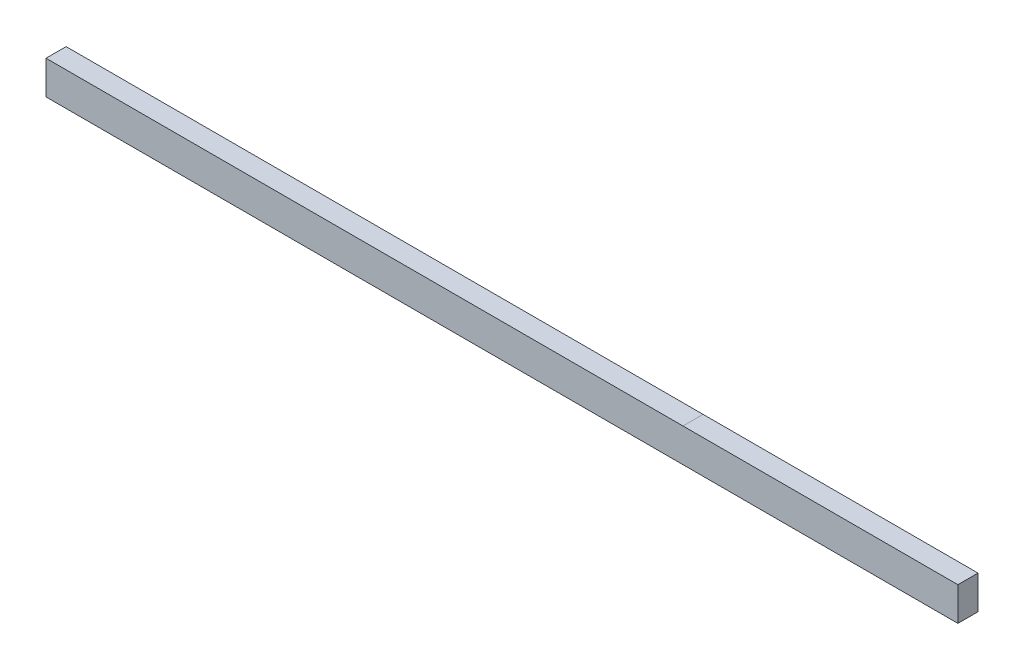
ISO-10303-21;
HEADER;
FILE_DESCRIPTION(('STEP AP214'),'2;1');
FILE_NAME('part.step','',(''),(''),'','','');
FILE_SCHEMA(('AUTOMOTIVE_DESIGN { 1 0 10303 214 1 1 1 1 }'));
ENDSEC;
DATA;
#1=APPLICATION_CONTEXT('core data for automotive mechanical design processes');
#2=APPLICATION_PROTOCOL_DEFINITION('international standard','automotive_design',2000,#1);
#3=PRODUCT_CONTEXT('',#1,'mechanical');
#4=PRODUCT('Part','Part','',(#3));
#5=PRODUCT_RELATED_PRODUCT_CATEGORY('part','',(#4));
#6=PRODUCT_DEFINITION_FORMATION('','',#4);
#7=PRODUCT_DEFINITION_CONTEXT('part definition',#1,'design');
#8=PRODUCT_DEFINITION('design','',#6,#7);
#9=PRODUCT_DEFINITION_SHAPE('','',#8);
#10=(LENGTH_UNIT() NAMED_UNIT(*) SI_UNIT(.MILLI.,.METRE.));
#11=(NAMED_UNIT(*) PLANE_ANGLE_UNIT() SI_UNIT($,.RADIAN.));
#12=(NAMED_UNIT(*) SI_UNIT($,.STERADIAN.) SOLID_ANGLE_UNIT());
#13=UNCERTAINTY_MEASURE_WITH_UNIT(LENGTH_MEASURE(1.E-05),#10,'distance_accuracy_value','');
#14=(GEOMETRIC_REPRESENTATION_CONTEXT(3) GLOBAL_UNCERTAINTY_ASSIGNED_CONTEXT((#13)) GLOBAL_UNIT_ASSIGNED_CONTEXT((#10,
#11,#12)) REPRESENTATION_CONTEXT('',''));
#15=CARTESIAN_POINT('',(0.,0.,0.));
#16=DIRECTION('',(0.,0.,1.));
#17=DIRECTION('',(1.,0.,0.));
#18=AXIS2_PLACEMENT_3D('',#15,#16,#17);
#19=CARTESIAN_POINT('',(680.,-12.5,7.5));
#20=DIRECTION('',(0.,1.,0.));
#21=DIRECTION('',(0.,0.,1.));
#22=AXIS2_PLACEMENT_3D('',#19,#20,#21);
#23=PLANE('',#22);
#24=DIRECTION('',(0.,0.,-1.));
#25=VECTOR('',#24,1.);
#26=CARTESIAN_POINT('',(600.,-12.5,7.5));
#27=LINE('',#26,#25);
#28=CARTESIAN_POINT('',(600.,-12.5,7.5));
#29=VERTEX_POINT('',#28);
#30=CARTESIAN_POINT('',(600.,-12.5,-7.5));
#31=VERTEX_POINT('',#30);
#32=EDGE_CURVE('E11',#29,#31,#27,.T.);
#33=ORIENTED_EDGE('',*,*,#32,.F.);
#34=DIRECTION('',(-1.,0.,0.));
#35=VECTOR('',#34,1.);
#36=CARTESIAN_POINT('',(680.,-12.5,7.5));
#37=LINE('',#36,#35);
#38=CARTESIAN_POINT('',(0.,-12.5,7.5));
#39=VERTEX_POINT('',#38);
#40=EDGE_CURVE('E82',#29,#39,#37,.T.);
#41=ORIENTED_EDGE('',*,*,#40,.T.);
#42=DIRECTION('',(0.,0.,-1.));
#43=VECTOR('',#42,1.);
#44=CARTESIAN_POINT('',(0.,-12.5,7.5));
#45=LINE('',#44,#43);
#46=CARTESIAN_POINT('',(0.,-12.5,-7.5));
#47=VERTEX_POINT('',#46);
#48=EDGE_CURVE('E84',#39,#47,#45,.T.);
#49=ORIENTED_EDGE('',*,*,#48,.T.);
#50=DIRECTION('',(-1.,0.,0.));
#51=VECTOR('',#50,1.);
#52=CARTESIAN_POINT('',(680.,-12.5,-7.5));
#53=LINE('',#52,#51);
#54=EDGE_CURVE('E124',#31,#47,#53,.T.);
#55=ORIENTED_EDGE('',*,*,#54,.F.);
#56=EDGE_LOOP('',(#33,#41,#49,#55));
#57=FACE_BOUND('',#56,.T.);
#58=ADVANCED_FACE('F33',(#57),#23,.F.);
#59=CARTESIAN_POINT('',(680.,12.5,7.5));
#60=DIRECTION('',(0.,-1.,0.));
#61=DIRECTION('',(0.,0.,-1.));
#62=AXIS2_PLACEMENT_3D('',#59,#60,#61);
#63=PLANE('',#62);
#64=DIRECTION('',(0.,0.,1.));
#65=VECTOR('',#64,1.);
#66=CARTESIAN_POINT('',(475.,12.5,7.5));
#67=LINE('',#66,#65);
#68=CARTESIAN_POINT('',(475.,12.5,-7.5));
#69=VERTEX_POINT('',#68);
#70=CARTESIAN_POINT('',(475.,12.5,7.5));
#71=VERTEX_POINT('',#70);
#72=EDGE_CURVE('E42',#69,#71,#67,.T.);
#73=ORIENTED_EDGE('',*,*,#72,.F.);
#74=DIRECTION('',(-1.,0.,0.));
#75=VECTOR('',#74,1.);
#76=CARTESIAN_POINT('',(680.,12.5,-7.5));
#77=LINE('',#76,#75);
#78=CARTESIAN_POINT('',(0.,12.5,-7.5));
#79=VERTEX_POINT('',#78);
#80=EDGE_CURVE('E120',#69,#79,#77,.T.);
#81=ORIENTED_EDGE('',*,*,#80,.T.);
#82=DIRECTION('',(0.,0.,1.));
#83=VECTOR('',#82,1.);
#84=CARTESIAN_POINT('',(0.,12.5,7.5));
#85=LINE('',#84,#83);
#86=CARTESIAN_POINT('',(0.,12.5,7.5));
#87=VERTEX_POINT('',#86);
#88=EDGE_CURVE('E107',#79,#87,#85,.T.);
#89=ORIENTED_EDGE('',*,*,#88,.T.);
#90=DIRECTION('',(-1.,0.,0.));
#91=VECTOR('',#90,1.);
#92=CARTESIAN_POINT('',(680.,12.5,7.5));
#93=LINE('',#92,#91);
#94=EDGE_CURVE('E102',#71,#87,#93,.T.);
#95=ORIENTED_EDGE('',*,*,#94,.F.);
#96=EDGE_LOOP('',(#73,#81,#89,#95));
#97=FACE_BOUND('',#96,.T.);
#98=ADVANCED_FACE('F137',(#97),#63,.F.);
#99=CARTESIAN_POINT('',(680.,12.5,7.5));
#100=DIRECTION('',(0.,0.,-1.));
#101=DIRECTION('',(0.,1.,0.));
#102=AXIS2_PLACEMENT_3D('',#99,#100,#101);
#103=PLANE('',#102);
#104=DIRECTION('',(0.,-1.,0.));
#105=VECTOR('',#104,1.);
#106=CARTESIAN_POINT('',(0.,12.5,7.5));
#107=LINE('',#106,#105);
#108=EDGE_CURVE('E96',#87,#39,#107,.T.);
#109=ORIENTED_EDGE('',*,*,#108,.T.);
#110=ORIENTED_EDGE('',*,*,#40,.F.);
#111=CARTESIAN_POINT('',(680.,-12.5,7.5));
#112=VERTEX_POINT('',#111);
#113=EDGE_CURVE('E89',#112,#29,#37,.T.);
#114=ORIENTED_EDGE('',*,*,#113,.F.);
#115=DIRECTION('',(0.,-1.,0.));
#116=VECTOR('',#115,1.);
#117=CARTESIAN_POINT('',(680.,12.5,7.5));
#118=LINE('',#117,#116);
#119=CARTESIAN_POINT('',(680.,12.5,7.5));
#120=VERTEX_POINT('',#119);
#121=EDGE_CURVE('E109',#120,#112,#118,.T.);
#122=ORIENTED_EDGE('',*,*,#121,.F.);
#123=EDGE_CURVE('E118',#120,#71,#93,.T.);
#124=ORIENTED_EDGE('',*,*,#123,.T.);
#125=ORIENTED_EDGE('',*,*,#94,.T.);
#126=EDGE_LOOP('',(#109,#110,#114,#122,#124,#125));
#127=FACE_BOUND('',#126,.T.);
#128=ADVANCED_FACE('F35',(#127),#103,.F.);
#129=ORIENTED_EDGE('',*,*,#113,.T.);
#130=ORIENTED_EDGE('',*,*,#32,.T.);
#131=CARTESIAN_POINT('',(680.,-12.5,-7.5));
#132=VERTEX_POINT('',#131);
#133=EDGE_CURVE('E90',#132,#31,#53,.T.);
#134=ORIENTED_EDGE('',*,*,#133,.F.);
#135=DIRECTION('',(0.,0.,-1.));
#136=VECTOR('',#135,1.);
#137=CARTESIAN_POINT('',(680.,-12.5,7.5));
#138=LINE('',#137,#136);
#139=EDGE_CURVE('E112',#112,#132,#138,.T.);
#140=ORIENTED_EDGE('',*,*,#139,.F.);
#141=EDGE_LOOP('',(#129,#130,#134,#140));
#142=FACE_BOUND('',#141,.T.);
#143=ADVANCED_FACE('F143',(#142),#23,.F.);
#144=CARTESIAN_POINT('',(680.,12.5,-7.5));
#145=DIRECTION('',(0.,0.,1.));
#146=DIRECTION('',(0.,-1.,0.));
#147=AXIS2_PLACEMENT_3D('',#144,#145,#146);
#148=PLANE('',#147);
#149=DIRECTION('',(0.,1.,0.));
#150=VECTOR('',#149,1.);
#151=CARTESIAN_POINT('',(0.,12.5,-7.5));
#152=LINE('',#151,#150);
#153=EDGE_CURVE('E98',#47,#79,#152,.T.);
#154=ORIENTED_EDGE('',*,*,#153,.T.);
#155=ORIENTED_EDGE('',*,*,#80,.F.);
#156=CARTESIAN_POINT('',(680.,12.5,-7.5));
#157=VERTEX_POINT('',#156);
#158=EDGE_CURVE('E121',#157,#69,#77,.T.);
#159=ORIENTED_EDGE('',*,*,#158,.F.);
#160=DIRECTION('',(0.,1.,0.));
#161=VECTOR('',#160,1.);
#162=CARTESIAN_POINT('',(680.,12.5,-7.5));
#163=LINE('',#162,#161);
#164=EDGE_CURVE('E114',#132,#157,#163,.T.);
#165=ORIENTED_EDGE('',*,*,#164,.F.);
#166=ORIENTED_EDGE('',*,*,#133,.T.);
#167=ORIENTED_EDGE('',*,*,#54,.T.);
#168=EDGE_LOOP('',(#154,#155,#159,#165,#166,#167));
#169=FACE_BOUND('',#168,.T.);
#170=ADVANCED_FACE('F142',(#169),#148,.F.);
#171=ORIENTED_EDGE('',*,*,#158,.T.);
#172=ORIENTED_EDGE('',*,*,#72,.T.);
#173=ORIENTED_EDGE('',*,*,#123,.F.);
#174=DIRECTION('',(0.,0.,1.));
#175=VECTOR('',#174,1.);
#176=CARTESIAN_POINT('',(680.,12.5,7.5));
#177=LINE('',#176,#175);
#178=EDGE_CURVE('E116',#157,#120,#177,.T.);
#179=ORIENTED_EDGE('',*,*,#178,.F.);
#180=EDGE_LOOP('',(#171,#172,#173,#179));
#181=FACE_BOUND('',#180,.T.);
#182=ADVANCED_FACE('F131',(#181),#63,.F.);
#183=CARTESIAN_POINT('',(680.,-12.5,7.5));
#184=DIRECTION('',(1.,0.,0.));
#185=DIRECTION('',(0.,0.,-1.));
#186=AXIS2_PLACEMENT_3D('',#183,#184,#185);
#187=PLANE('',#186);
#188=ORIENTED_EDGE('',*,*,#121,.T.);
#189=ORIENTED_EDGE('',*,*,#139,.T.);
#190=ORIENTED_EDGE('',*,*,#164,.T.);
#191=ORIENTED_EDGE('',*,*,#178,.T.);
#192=EDGE_LOOP('',(#188,#189,#190,#191));
#193=FACE_BOUND('',#192,.T.);
#194=ADVANCED_FACE('F139',(#193),#187,.T.);
#195=CARTESIAN_POINT('',(0.,-12.5,7.5));
#196=DIRECTION('',(1.,0.,0.));
#197=DIRECTION('',(0.,0.,-1.));
#198=AXIS2_PLACEMENT_3D('',#195,#196,#197);
#199=PLANE('',#198);
#200=ORIENTED_EDGE('',*,*,#108,.F.);
#201=ORIENTED_EDGE('',*,*,#88,.F.);
#202=ORIENTED_EDGE('',*,*,#153,.F.);
#203=ORIENTED_EDGE('',*,*,#48,.F.);
#204=EDGE_LOOP('',(#200,#201,#202,#203));
#205=FACE_BOUND('',#204,.T.);
#206=ADVANCED_FACE('F94',(#205),#199,.F.);
#207=CLOSED_SHELL('',(#58,#98,#128,#143,#170,#182,#194,#206));
#208=MANIFOLD_SOLID_BREP('B2',#207);
#209=ADVANCED_BREP_SHAPE_REPRESENTATION('',(#18,#208),#14);
#210=SHAPE_DEFINITION_REPRESENTATION(#9,#209);
ENDSEC;
END-ISO-10303-21;
